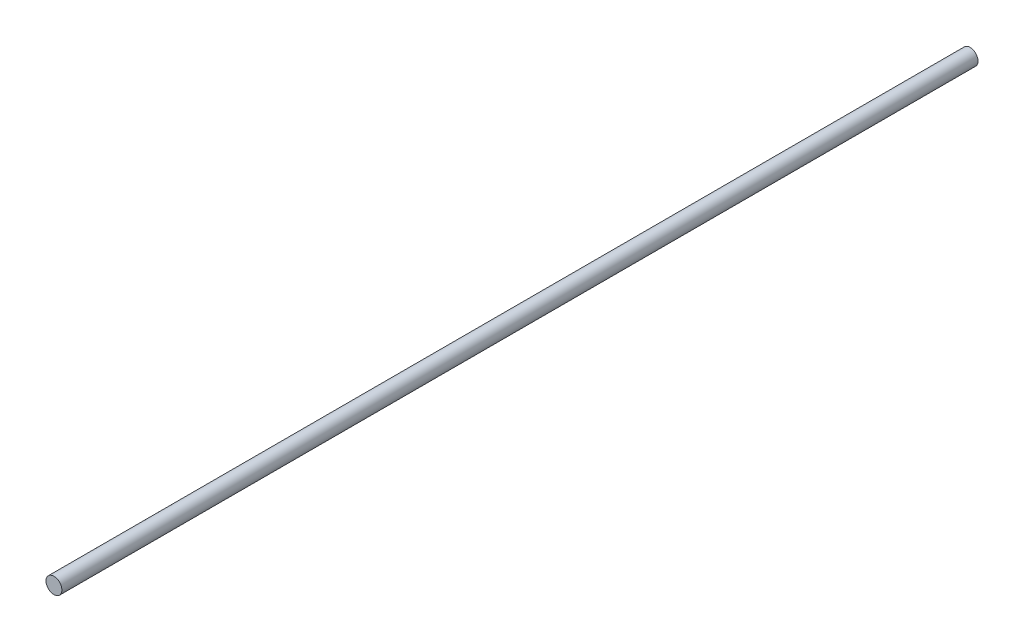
ISO-10303-21;
HEADER;
FILE_DESCRIPTION(('STEP AP214'),'2;1');
FILE_NAME('part.step','',(''),(''),'','','');
FILE_SCHEMA(('AUTOMOTIVE_DESIGN { 1 0 10303 214 1 1 1 1 }'));
ENDSEC;
DATA;
#1=APPLICATION_CONTEXT('core data for automotive mechanical design processes');
#2=APPLICATION_PROTOCOL_DEFINITION('international standard','automotive_design',2000,#1);
#3=PRODUCT_CONTEXT('',#1,'mechanical');
#4=PRODUCT('Part','Part','',(#3));
#5=PRODUCT_RELATED_PRODUCT_CATEGORY('part','',(#4));
#6=PRODUCT_DEFINITION_FORMATION('','',#4);
#7=PRODUCT_DEFINITION_CONTEXT('part definition',#1,'design');
#8=PRODUCT_DEFINITION('design','',#6,#7);
#9=PRODUCT_DEFINITION_SHAPE('','',#8);
#10=(LENGTH_UNIT() NAMED_UNIT(*) SI_UNIT(.MILLI.,.METRE.));
#11=(NAMED_UNIT(*) PLANE_ANGLE_UNIT() SI_UNIT($,.RADIAN.));
#12=(NAMED_UNIT(*) SI_UNIT($,.STERADIAN.) SOLID_ANGLE_UNIT());
#13=UNCERTAINTY_MEASURE_WITH_UNIT(LENGTH_MEASURE(1.E-05),#10,'distance_accuracy_value','');
#14=(GEOMETRIC_REPRESENTATION_CONTEXT(3) GLOBAL_UNCERTAINTY_ASSIGNED_CONTEXT((#13)) GLOBAL_UNIT_ASSIGNED_CONTEXT((#10,
#11,#12)) REPRESENTATION_CONTEXT('',''));
#15=CARTESIAN_POINT('',(0.,0.,0.));
#16=DIRECTION('',(0.,0.,1.));
#17=DIRECTION('',(1.,0.,0.));
#18=AXIS2_PLACEMENT_3D('',#15,#16,#17);
#19=CARTESIAN_POINT('',(0.,0.,457.2));
#20=DIRECTION('',(0.,0.,-1.));
#21=DIRECTION('',(-1.,0.,0.));
#22=AXIS2_PLACEMENT_3D('',#19,#20,#21);
#23=CYLINDRICAL_SURFACE('',#22,3.96875);
#24=CARTESIAN_POINT('',(0.,0.,457.2));
#25=DIRECTION('',(0.,0.,1.));
#26=DIRECTION('',(1.,0.,0.));
#27=AXIS2_PLACEMENT_3D('',#24,#25,#26);
#28=CIRCLE('',#27,3.96875);
#29=CARTESIAN_POINT('',(3.96875,0.,457.2));
#30=VERTEX_POINT('',#29);
#31=EDGE_CURVE('E12',#30,#30,#28,.T.);
#32=ORIENTED_EDGE('',*,*,#31,.F.);
#33=EDGE_LOOP('',(#32));
#34=FACE_BOUND('',#33,.T.);
#35=CARTESIAN_POINT('',(0.,0.,0.));
#36=DIRECTION('',(0.,0.,1.));
#37=DIRECTION('',(1.,0.,0.));
#38=AXIS2_PLACEMENT_3D('',#35,#36,#37);
#39=CIRCLE('',#38,3.96875);
#40=CARTESIAN_POINT('',(3.96875,0.,0.));
#41=VERTEX_POINT('',#40);
#42=EDGE_CURVE('E44',#41,#41,#39,.T.);
#43=ORIENTED_EDGE('',*,*,#42,.T.);
#44=EDGE_LOOP('',(#43));
#45=FACE_BOUND('',#44,.T.);
#46=ADVANCED_FACE('F41',(#34,#45),#23,.T.);
#47=CARTESIAN_POINT('',(0.,0.,457.2));
#48=DIRECTION('',(0.,0.,1.));
#49=DIRECTION('',(1.,0.,0.));
#50=AXIS2_PLACEMENT_3D('',#47,#48,#49);
#51=PLANE('',#50);
#52=ORIENTED_EDGE('',*,*,#31,.T.);
#53=EDGE_LOOP('',(#52));
#54=FACE_BOUND('',#53,.T.);
#55=ADVANCED_FACE('F56',(#54),#51,.T.);
#56=CARTESIAN_POINT('',(0.,0.,0.));
#57=DIRECTION('',(0.,0.,1.));
#58=DIRECTION('',(1.,0.,0.));
#59=AXIS2_PLACEMENT_3D('',#56,#57,#58);
#60=PLANE('',#59);
#61=ORIENTED_EDGE('',*,*,#42,.F.);
#62=EDGE_LOOP('',(#61));
#63=FACE_BOUND('',#62,.T.);
#64=ADVANCED_FACE('F54',(#63),#60,.F.);
#65=CLOSED_SHELL('',(#46,#55,#64));
#66=MANIFOLD_SOLID_BREP('B2',#65);
#67=ADVANCED_BREP_SHAPE_REPRESENTATION('',(#18,#66),#14);
#68=SHAPE_DEFINITION_REPRESENTATION(#9,#67);
ENDSEC;
END-ISO-10303-21;
